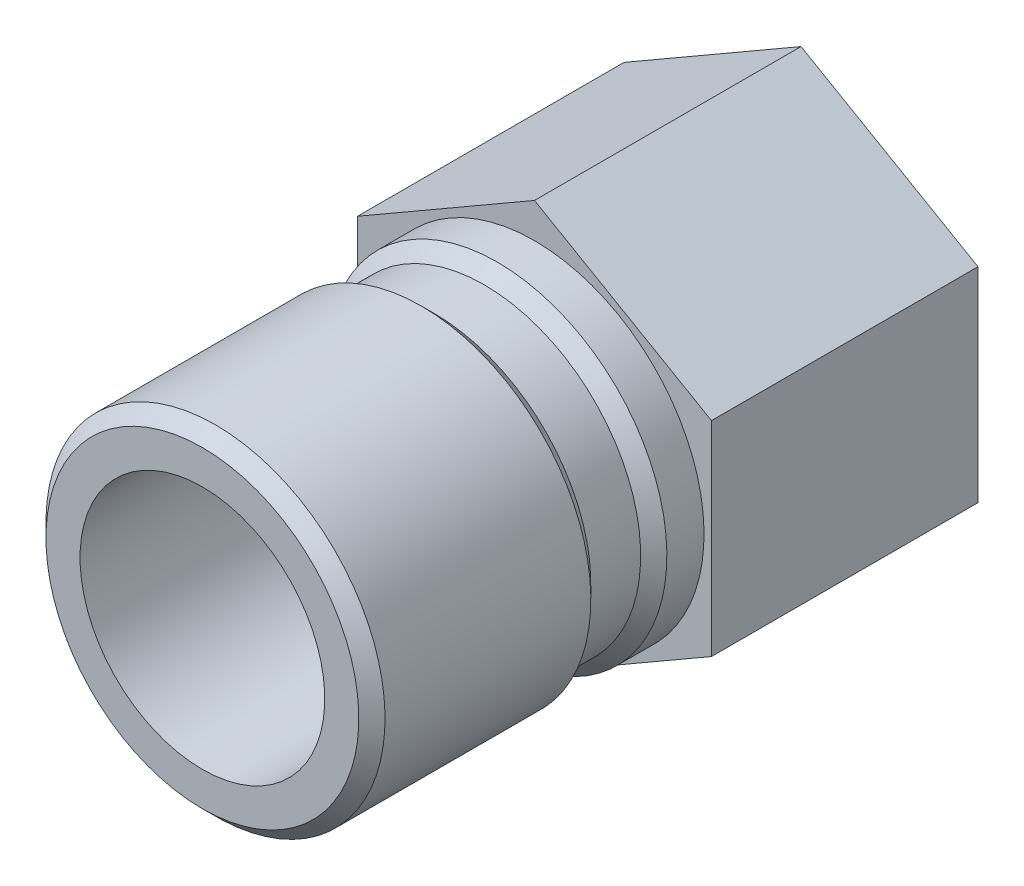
from build123d import *

# Parameters (mm, degrees)
SKETCH2_OUTSIDE_W  = 36.648
SKETCH2_OUTSIDE_H  = 36.648
CUT_EXTRUDE1_DEPTH = 27.067037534


with BuildPart() as part:
    # Sketch1 → Revolve1 (revolve)
    with BuildSketch(Plane(origin=(0, 0, 0), x_dir=(0, 0, -1), z_dir=(1, 0, 0))):
        Polygon((-19.304, 7.112), (-19.304, 9.0932), (-18.542, 9.8552), (-6.5786, 9.8552), (-5.8166, 9.0932), (-2.921, 9.0932), (-2.159, 9.8552), (0, 9.8552), (0, 12.386404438), (15.494, 12.386404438), (15.494, 7.828833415), (3.5687, 7.45617), (3.385701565, 7.112), align=None)
    revolve(axis=Axis((0, 0, 0), (0, 0, 1)))

    # Sketch2 outside → Cut-Extrude1 (cut, through all)
    with BuildSketch(Plane.XY):
        Rectangle(SKETCH2_OUTSIDE_W, SKETCH2_OUTSIDE_H)
        Polygon((-10.287, 5.939202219), (-10.287, -5.939202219), (0, -11.878404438), (10.287, -5.939202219), (10.287, 5.939202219), (0, 11.878404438), align=None, mode=Mode.SUBTRACT)
    extrude(amount=-CUT_EXTRUDE1_DEPTH, mode=Mode.SUBTRACT)


solid = part.part
